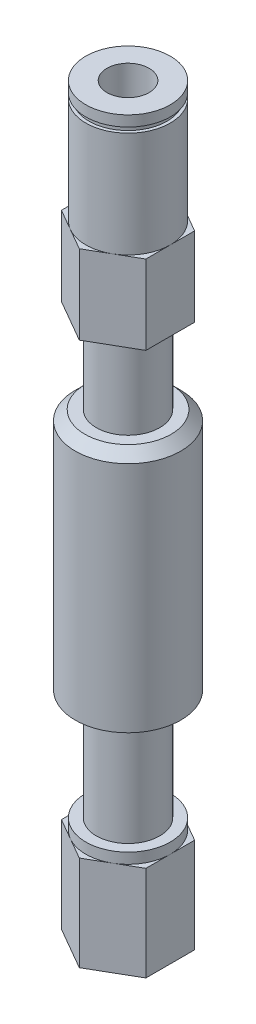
ISO-10303-21;
HEADER;
FILE_DESCRIPTION(('STEP AP214'),'2;1');
FILE_NAME('part.step','',(''),(''),'','','');
FILE_SCHEMA(('AUTOMOTIVE_DESIGN { 1 0 10303 214 1 1 1 1 }'));
ENDSEC;
DATA;
#1=APPLICATION_CONTEXT('core data for automotive mechanical design processes');
#2=APPLICATION_PROTOCOL_DEFINITION('international standard','automotive_design',2000,#1);
#3=PRODUCT_CONTEXT('',#1,'mechanical');
#4=PRODUCT('Part','Part','',(#3));
#5=PRODUCT_RELATED_PRODUCT_CATEGORY('part','',(#4));
#6=PRODUCT_DEFINITION_FORMATION('','',#4);
#7=PRODUCT_DEFINITION_CONTEXT('part definition',#1,'design');
#8=PRODUCT_DEFINITION('design','',#6,#7);
#9=PRODUCT_DEFINITION_SHAPE('','',#8);
#10=(LENGTH_UNIT() NAMED_UNIT(*) SI_UNIT(.MILLI.,.METRE.));
#11=(NAMED_UNIT(*) PLANE_ANGLE_UNIT() SI_UNIT($,.RADIAN.));
#12=(NAMED_UNIT(*) SI_UNIT($,.STERADIAN.) SOLID_ANGLE_UNIT());
#13=UNCERTAINTY_MEASURE_WITH_UNIT(LENGTH_MEASURE(1.E-05),#10,'distance_accuracy_value','');
#14=(GEOMETRIC_REPRESENTATION_CONTEXT(3) GLOBAL_UNCERTAINTY_ASSIGNED_CONTEXT((#13)) GLOBAL_UNIT_ASSIGNED_CONTEXT((#10,
#11,#12)) REPRESENTATION_CONTEXT('',''));
#15=CARTESIAN_POINT('',(0.,0.,0.));
#16=DIRECTION('',(0.,0.,1.));
#17=DIRECTION('',(1.,0.,0.));
#18=AXIS2_PLACEMENT_3D('',#15,#16,#17);
#19=CARTESIAN_POINT('',(0.,70.5,2.));
#20=DIRECTION('',(0.,1.,0.));
#21=DIRECTION('',(0.,0.,1.));
#22=AXIS2_PLACEMENT_3D('',#19,#20,#21);
#23=PLANE('',#22);
#24=CARTESIAN_POINT('',(0.,70.5,0.));
#25=DIRECTION('',(0.,-1.,0.));
#26=DIRECTION('',(0.,0.,-1.));
#27=AXIS2_PLACEMENT_3D('',#24,#25,#26);
#28=CIRCLE('',#27,2.);
#29=CARTESIAN_POINT('',(0.,70.5,-2.));
#30=VERTEX_POINT('',#29);
#31=EDGE_CURVE('E385',#30,#30,#28,.T.);
#32=ORIENTED_EDGE('',*,*,#31,.T.);
#33=EDGE_LOOP('',(#32));
#34=FACE_BOUND('',#33,.T.);
#35=CARTESIAN_POINT('',(0.,70.5,0.));
#36=DIRECTION('',(0.,-1.,0.));
#37=DIRECTION('',(0.,0.,-1.));
#38=AXIS2_PLACEMENT_3D('',#35,#36,#37);
#39=CIRCLE('',#38,4.);
#40=CARTESIAN_POINT('',(0.,70.5,-4.));
#41=VERTEX_POINT('',#40);
#42=EDGE_CURVE('E19',#41,#41,#39,.T.);
#43=ORIENTED_EDGE('',*,*,#42,.F.);
#44=EDGE_LOOP('',(#43));
#45=FACE_BOUND('',#44,.T.);
#46=ADVANCED_FACE('F16',(#34,#45),#23,.T.);
#47=CARTESIAN_POINT('',(0.,70.5,0.));
#48=DIRECTION('',(0.,-1.,0.));
#49=DIRECTION('',(0.,0.,-1.));
#50=AXIS2_PLACEMENT_3D('',#47,#48,#49);
#51=CYLINDRICAL_SURFACE('',#50,4.);
#52=ORIENTED_EDGE('',*,*,#42,.T.);
#53=EDGE_LOOP('',(#52));
#54=FACE_BOUND('',#53,.T.);
#55=CARTESIAN_POINT('',(0.,69.5,0.));
#56=DIRECTION('',(0.,-1.,0.));
#57=DIRECTION('',(0.,0.,-1.));
#58=AXIS2_PLACEMENT_3D('',#55,#56,#57);
#59=CIRCLE('',#58,4.);
#60=CARTESIAN_POINT('',(0.,69.5,-4.));
#61=VERTEX_POINT('',#60);
#62=EDGE_CURVE('E383',#61,#61,#59,.T.);
#63=ORIENTED_EDGE('',*,*,#62,.F.);
#64=EDGE_LOOP('',(#63));
#65=FACE_BOUND('',#64,.T.);
#66=ADVANCED_FACE('F392',(#54,#65),#51,.T.);
#67=CARTESIAN_POINT('',(0.,70.5,0.));
#68=DIRECTION('',(0.,-1.,0.));
#69=DIRECTION('',(0.,0.,-1.));
#70=AXIS2_PLACEMENT_3D('',#67,#68,#69);
#71=CYLINDRICAL_SURFACE('',#70,2.);
#72=CARTESIAN_POINT('',(0.,66.5,0.));
#73=DIRECTION('',(0.,-1.,0.));
#74=DIRECTION('',(0.,0.,-1.));
#75=AXIS2_PLACEMENT_3D('',#72,#73,#74);
#76=CIRCLE('',#75,2.);
#77=CARTESIAN_POINT('',(0.,66.5,-2.));
#78=VERTEX_POINT('',#77);
#79=EDGE_CURVE('E380',#78,#78,#76,.F.);
#80=ORIENTED_EDGE('',*,*,#79,.F.);
#81=EDGE_LOOP('',(#80));
#82=FACE_BOUND('',#81,.T.);
#83=ORIENTED_EDGE('',*,*,#31,.F.);
#84=EDGE_LOOP('',(#83));
#85=FACE_BOUND('',#84,.T.);
#86=ADVANCED_FACE('F401',(#82,#85),#71,.F.);
#87=CARTESIAN_POINT('',(0.,69.5,4.));
#88=DIRECTION('',(0.,-1.,0.));
#89=DIRECTION('',(0.,0.,-1.));
#90=AXIS2_PLACEMENT_3D('',#87,#88,#89);
#91=PLANE('',#90);
#92=ORIENTED_EDGE('',*,*,#62,.T.);
#93=EDGE_LOOP('',(#92));
#94=FACE_BOUND('',#93,.T.);
#95=CARTESIAN_POINT('',(0.,69.5,0.));
#96=DIRECTION('',(0.,-1.,0.));
#97=DIRECTION('',(0.,0.,-1.));
#98=AXIS2_PLACEMENT_3D('',#95,#96,#97);
#99=CIRCLE('',#98,3.7);
#100=CARTESIAN_POINT('',(0.,69.5,-3.7));
#101=VERTEX_POINT('',#100);
#102=EDGE_CURVE('E377',#101,#101,#99,.T.);
#103=ORIENTED_EDGE('',*,*,#102,.F.);
#104=EDGE_LOOP('',(#103));
#105=FACE_BOUND('',#104,.T.);
#106=ADVANCED_FACE('F554',(#94,#105),#91,.T.);
#107=CARTESIAN_POINT('',(0.,66.5,1.));
#108=DIRECTION('',(0.,1.,0.));
#109=DIRECTION('',(0.,0.,1.));
#110=AXIS2_PLACEMENT_3D('',#107,#108,#109);
#111=PLANE('',#110);
#112=CARTESIAN_POINT('',(0.,66.5,0.));
#113=DIRECTION('',(0.,-1.,0.));
#114=DIRECTION('',(0.,0.,-1.));
#115=AXIS2_PLACEMENT_3D('',#112,#113,#114);
#116=CIRCLE('',#115,1.);
#117=CARTESIAN_POINT('',(0.,66.5,-1.));
#118=VERTEX_POINT('',#117);
#119=EDGE_CURVE('E374',#118,#118,#116,.T.);
#120=ORIENTED_EDGE('',*,*,#119,.T.);
#121=EDGE_LOOP('',(#120));
#122=FACE_BOUND('',#121,.T.);
#123=ORIENTED_EDGE('',*,*,#79,.T.);
#124=EDGE_LOOP('',(#123));
#125=FACE_BOUND('',#124,.T.);
#126=ADVANCED_FACE('F550',(#122,#125),#111,.T.);
#127=CARTESIAN_POINT('',(0.,70.5,0.));
#128=DIRECTION('',(0.,-1.,0.));
#129=DIRECTION('',(0.,0.,-1.));
#130=AXIS2_PLACEMENT_3D('',#127,#128,#129);
#131=CYLINDRICAL_SURFACE('',#130,3.7);
#132=ORIENTED_EDGE('',*,*,#102,.T.);
#133=EDGE_LOOP('',(#132));
#134=FACE_BOUND('',#133,.T.);
#135=CARTESIAN_POINT('',(0.,69.,0.));
#136=DIRECTION('',(0.,-1.,0.));
#137=DIRECTION('',(0.,0.,-1.));
#138=AXIS2_PLACEMENT_3D('',#135,#136,#137);
#139=CIRCLE('',#138,3.7);
#140=CARTESIAN_POINT('',(0.,69.,-3.7));
#141=VERTEX_POINT('',#140);
#142=EDGE_CURVE('E371',#141,#141,#139,.T.);
#143=ORIENTED_EDGE('',*,*,#142,.F.);
#144=EDGE_LOOP('',(#143));
#145=FACE_BOUND('',#144,.T.);
#146=ADVANCED_FACE('F546',(#134,#145),#131,.T.);
#147=CARTESIAN_POINT('',(0.,70.5,0.));
#148=DIRECTION('',(0.,-1.,0.));
#149=DIRECTION('',(0.,0.,-1.));
#150=AXIS2_PLACEMENT_3D('',#147,#148,#149);
#151=CYLINDRICAL_SURFACE('',#150,1.);
#152=CARTESIAN_POINT('',(0.,0.,0.));
#153=DIRECTION('',(0.,-1.,0.));
#154=DIRECTION('',(0.,0.,-1.));
#155=AXIS2_PLACEMENT_3D('',#152,#153,#154);
#156=CIRCLE('',#155,1.);
#157=CARTESIAN_POINT('',(0.,0.,-1.));
#158=VERTEX_POINT('',#157);
#159=EDGE_CURVE('E368',#158,#158,#156,.F.);
#160=ORIENTED_EDGE('',*,*,#159,.F.);
#161=EDGE_LOOP('',(#160));
#162=FACE_BOUND('',#161,.T.);
#163=ORIENTED_EDGE('',*,*,#119,.F.);
#164=EDGE_LOOP('',(#163));
#165=FACE_BOUND('',#164,.T.);
#166=ADVANCED_FACE('F542',(#162,#165),#151,.F.);
#167=CARTESIAN_POINT('',(0.,69.,3.7));
#168=DIRECTION('',(0.,1.,0.));
#169=DIRECTION('',(0.,0.,1.));
#170=AXIS2_PLACEMENT_3D('',#167,#168,#169);
#171=PLANE('',#170);
#172=ORIENTED_EDGE('',*,*,#142,.T.);
#173=EDGE_LOOP('',(#172));
#174=FACE_BOUND('',#173,.T.);
#175=CARTESIAN_POINT('',(0.,69.,0.));
#176=DIRECTION('',(0.,-1.,0.));
#177=DIRECTION('',(0.,0.,-1.));
#178=AXIS2_PLACEMENT_3D('',#175,#176,#177);
#179=CIRCLE('',#178,4.);
#180=CARTESIAN_POINT('',(0.,69.,-4.));
#181=VERTEX_POINT('',#180);
#182=EDGE_CURVE('E298',#181,#181,#179,.T.);
#183=ORIENTED_EDGE('',*,*,#182,.F.);
#184=EDGE_LOOP('',(#183));
#185=FACE_BOUND('',#184,.T.);
#186=ADVANCED_FACE('F538',(#174,#185),#171,.T.);
#187=CARTESIAN_POINT('',(0.,0.,5.));
#188=DIRECTION('',(0.,-1.,0.));
#189=DIRECTION('',(0.,0.,-1.));
#190=AXIS2_PLACEMENT_3D('',#187,#188,#189);
#191=PLANE('',#190);
#192=DIRECTION('',(-0.866025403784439,0.,-0.5));
#193=VECTOR('',#192,1.);
#194=CARTESIAN_POINT('',(-4.,0.,2.3094010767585));
#195=LINE('',#194,#193);
#196=CARTESIAN_POINT('',(0.,0.,4.61880215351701));
#197=VERTEX_POINT('',#196);
#198=CARTESIAN_POINT('',(-4.,0.,2.3094010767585));
#199=VERTEX_POINT('',#198);
#200=EDGE_CURVE('E290',#197,#199,#195,.T.);
#201=ORIENTED_EDGE('',*,*,#200,.T.);
#202=DIRECTION('',(0.,0.,-1.));
#203=VECTOR('',#202,1.);
#204=CARTESIAN_POINT('',(-4.,0.,-2.3094010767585));
#205=LINE('',#204,#203);
#206=CARTESIAN_POINT('',(-4.,0.,-2.3094010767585));
#207=VERTEX_POINT('',#206);
#208=EDGE_CURVE('E149',#199,#207,#205,.T.);
#209=ORIENTED_EDGE('',*,*,#208,.T.);
#210=DIRECTION('',(0.866025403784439,0.,-0.5));
#211=VECTOR('',#210,1.);
#212=CARTESIAN_POINT('',(0.,0.,-4.61880215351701));
#213=LINE('',#212,#211);
#214=CARTESIAN_POINT('',(0.,0.,-4.61880215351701));
#215=VERTEX_POINT('',#214);
#216=EDGE_CURVE('E270',#207,#215,#213,.T.);
#217=ORIENTED_EDGE('',*,*,#216,.T.);
#218=DIRECTION('',(0.866025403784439,0.,0.5));
#219=VECTOR('',#218,1.);
#220=CARTESIAN_POINT('',(4.,0.,-2.3094010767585));
#221=LINE('',#220,#219);
#222=CARTESIAN_POINT('',(4.,0.,-2.3094010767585));
#223=VERTEX_POINT('',#222);
#224=EDGE_CURVE('E275',#215,#223,#221,.T.);
#225=ORIENTED_EDGE('',*,*,#224,.T.);
#226=DIRECTION('',(0.,0.,1.));
#227=VECTOR('',#226,1.);
#228=CARTESIAN_POINT('',(4.,0.,2.3094010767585));
#229=LINE('',#228,#227);
#230=CARTESIAN_POINT('',(4.,0.,2.3094010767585));
#231=VERTEX_POINT('',#230);
#232=EDGE_CURVE('E280',#223,#231,#229,.T.);
#233=ORIENTED_EDGE('',*,*,#232,.T.);
#234=DIRECTION('',(-0.866025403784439,0.,0.5));
#235=VECTOR('',#234,1.);
#236=CARTESIAN_POINT('',(0.,0.,4.61880215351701));
#237=LINE('',#236,#235);
#238=EDGE_CURVE('E285',#231,#197,#237,.T.);
#239=ORIENTED_EDGE('',*,*,#238,.T.);
#240=EDGE_LOOP('',(#201,#209,#217,#225,#233,#239));
#241=FACE_BOUND('',#240,.T.);
#242=ORIENTED_EDGE('',*,*,#159,.T.);
#243=EDGE_LOOP('',(#242));
#244=FACE_BOUND('',#243,.T.);
#245=ADVANCED_FACE('F534',(#241,#244),#191,.T.);
#246=CARTESIAN_POINT('',(0.,70.5,0.));
#247=DIRECTION('',(0.,-1.,0.));
#248=DIRECTION('',(0.,0.,-1.));
#249=AXIS2_PLACEMENT_3D('',#246,#247,#248);
#250=CYLINDRICAL_SURFACE('',#249,4.);
#251=ORIENTED_EDGE('',*,*,#182,.T.);
#252=EDGE_LOOP('',(#251));
#253=FACE_BOUND('',#252,.T.);
#254=CARTESIAN_POINT('',(0.,59.,0.));
#255=DIRECTION('',(0.,-1.,0.));
#256=DIRECTION('',(0.,0.,-1.));
#257=AXIS2_PLACEMENT_3D('',#254,#255,#256);
#258=CIRCLE('',#257,4.);
#259=CARTESIAN_POINT('',(-2.,59.,-3.46410161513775));
#260=VERTEX_POINT('',#259);
#261=CARTESIAN_POINT('',(2.,59.,-3.46410161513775));
#262=VERTEX_POINT('',#261);
#263=EDGE_CURVE('E137',#260,#262,#258,.T.);
#264=ORIENTED_EDGE('',*,*,#263,.F.);
#265=CARTESIAN_POINT('',(0.,59.,0.));
#266=DIRECTION('',(0.,-1.,0.));
#267=DIRECTION('',(0.,0.,-1.));
#268=AXIS2_PLACEMENT_3D('',#265,#266,#267);
#269=CIRCLE('',#268,4.);
#270=CARTESIAN_POINT('',(-4.,59.,0.));
#271=VERTEX_POINT('',#270);
#272=EDGE_CURVE('E141',#271,#260,#269,.T.);
#273=ORIENTED_EDGE('',*,*,#272,.F.);
#274=CARTESIAN_POINT('',(0.,59.,0.));
#275=DIRECTION('',(0.,-1.,0.));
#276=DIRECTION('',(0.,0.,-1.));
#277=AXIS2_PLACEMENT_3D('',#274,#275,#276);
#278=CIRCLE('',#277,4.);
#279=CARTESIAN_POINT('',(-2.,59.,3.46410161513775));
#280=VERTEX_POINT('',#279);
#281=EDGE_CURVE('E166',#280,#271,#278,.T.);
#282=ORIENTED_EDGE('',*,*,#281,.F.);
#283=CARTESIAN_POINT('',(0.,59.,0.));
#284=DIRECTION('',(0.,-1.,0.));
#285=DIRECTION('',(0.,0.,-1.));
#286=AXIS2_PLACEMENT_3D('',#283,#284,#285);
#287=CIRCLE('',#286,4.);
#288=CARTESIAN_POINT('',(2.,59.,3.46410161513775));
#289=VERTEX_POINT('',#288);
#290=EDGE_CURVE('E167',#289,#280,#287,.T.);
#291=ORIENTED_EDGE('',*,*,#290,.F.);
#292=CARTESIAN_POINT('',(0.,59.,0.));
#293=DIRECTION('',(0.,-1.,0.));
#294=DIRECTION('',(0.,0.,-1.));
#295=AXIS2_PLACEMENT_3D('',#292,#293,#294);
#296=CIRCLE('',#295,4.);
#297=CARTESIAN_POINT('',(4.,59.,0.));
#298=VERTEX_POINT('',#297);
#299=EDGE_CURVE('E362',#298,#289,#296,.T.);
#300=ORIENTED_EDGE('',*,*,#299,.F.);
#301=CARTESIAN_POINT('',(0.,59.,0.));
#302=DIRECTION('',(0.,-1.,0.));
#303=DIRECTION('',(0.,0.,-1.));
#304=AXIS2_PLACEMENT_3D('',#301,#302,#303);
#305=CIRCLE('',#304,4.);
#306=EDGE_CURVE('E144',#262,#298,#305,.T.);
#307=ORIENTED_EDGE('',*,*,#306,.F.);
#308=EDGE_LOOP('',(#264,#273,#282,#291,#300,#307));
#309=FACE_BOUND('',#308,.T.);
#310=ADVANCED_FACE('F139',(#253,#309),#250,.T.);
#311=CARTESIAN_POINT('',(-4.,9.,2.3094010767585));
#312=DIRECTION('',(0.5,0.,-0.866025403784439));
#313=DIRECTION('',(-0.866025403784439,0.,-0.5));
#314=AXIS2_PLACEMENT_3D('',#311,#312,#313);
#315=PLANE('',#314);
#316=DIRECTION('',(0.,1.,0.));
#317=VECTOR('',#316,1.);
#318=CARTESIAN_POINT('',(0.,9.,4.61880215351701));
#319=LINE('',#318,#317);
#320=CARTESIAN_POINT('',(0.,9.,4.61880215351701));
#321=VERTEX_POINT('',#320);
#322=EDGE_CURVE('E288',#197,#321,#319,.T.);
#323=ORIENTED_EDGE('',*,*,#322,.T.);
#324=DIRECTION('',(0.866025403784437,0.,0.5));
#325=VECTOR('',#324,1.);
#326=CARTESIAN_POINT('',(-2.,9.,3.46410161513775));
#327=LINE('',#326,#325);
#328=CARTESIAN_POINT('',(-2.,9.,3.46410161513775));
#329=VERTEX_POINT('',#328);
#330=EDGE_CURVE('E863',#329,#321,#327,.T.);
#331=ORIENTED_EDGE('',*,*,#330,.F.);
#332=DIRECTION('',(0.866025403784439,0.,0.5));
#333=VECTOR('',#332,1.);
#334=CARTESIAN_POINT('',(-4.,9.,2.3094010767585));
#335=LINE('',#334,#333);
#336=CARTESIAN_POINT('',(-4.,9.,2.3094010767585));
#337=VERTEX_POINT('',#336);
#338=EDGE_CURVE('E358',#337,#329,#335,.T.);
#339=ORIENTED_EDGE('',*,*,#338,.F.);
#340=DIRECTION('',(0.,1.,0.));
#341=VECTOR('',#340,1.);
#342=CARTESIAN_POINT('',(-4.,9.,2.3094010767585));
#343=LINE('',#342,#341);
#344=EDGE_CURVE('E269',#337,#199,#343,.F.);
#345=ORIENTED_EDGE('',*,*,#344,.T.);
#346=ORIENTED_EDGE('',*,*,#200,.F.);
#347=EDGE_LOOP('',(#323,#331,#339,#345,#346));
#348=FACE_BOUND('',#347,.T.);
#349=ADVANCED_FACE('F527',(#348),#315,.F.);
#350=CARTESIAN_POINT('',(0.,9.,4.61880215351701));
#351=DIRECTION('',(-0.5,0.,-0.866025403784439));
#352=DIRECTION('',(-0.866025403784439,0.,0.5));
#353=AXIS2_PLACEMENT_3D('',#350,#351,#352);
#354=PLANE('',#353);
#355=DIRECTION('',(0.,1.,0.));
#356=VECTOR('',#355,1.);
#357=CARTESIAN_POINT('',(4.,9.,2.3094010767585));
#358=LINE('',#357,#356);
#359=CARTESIAN_POINT('',(4.,9.,2.3094010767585));
#360=VERTEX_POINT('',#359);
#361=EDGE_CURVE('E283',#231,#360,#358,.T.);
#362=ORIENTED_EDGE('',*,*,#361,.T.);
#363=DIRECTION('',(0.866025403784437,0.,-0.5));
#364=VECTOR('',#363,1.);
#365=CARTESIAN_POINT('',(2.,9.,3.46410161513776));
#366=LINE('',#365,#364);
#367=CARTESIAN_POINT('',(2.,9.,3.46410161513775));
#368=VERTEX_POINT('',#367);
#369=EDGE_CURVE('E859',#368,#360,#366,.T.);
#370=ORIENTED_EDGE('',*,*,#369,.F.);
#371=DIRECTION('',(0.866025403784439,0.,-0.5));
#372=VECTOR('',#371,1.);
#373=CARTESIAN_POINT('',(0.,9.,4.61880215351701));
#374=LINE('',#373,#372);
#375=EDGE_CURVE('E861',#321,#368,#374,.T.);
#376=ORIENTED_EDGE('',*,*,#375,.F.);
#377=ORIENTED_EDGE('',*,*,#322,.F.);
#378=ORIENTED_EDGE('',*,*,#238,.F.);
#379=EDGE_LOOP('',(#362,#370,#376,#377,#378));
#380=FACE_BOUND('',#379,.T.);
#381=ADVANCED_FACE('F523',(#380),#354,.F.);
#382=CARTESIAN_POINT('',(4.,9.,2.3094010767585));
#383=DIRECTION('',(-1.,0.,0.));
#384=DIRECTION('',(0.,0.,1.));
#385=AXIS2_PLACEMENT_3D('',#382,#383,#384);
#386=PLANE('',#385);
#387=DIRECTION('',(0.,1.,0.));
#388=VECTOR('',#387,1.);
#389=CARTESIAN_POINT('',(4.,9.,-2.3094010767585));
#390=LINE('',#389,#388);
#391=CARTESIAN_POINT('',(4.,9.,-2.3094010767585));
#392=VERTEX_POINT('',#391);
#393=EDGE_CURVE('E278',#223,#392,#390,.T.);
#394=ORIENTED_EDGE('',*,*,#393,.T.);
#395=DIRECTION('',(0.,0.,1.));
#396=VECTOR('',#395,1.);
#397=CARTESIAN_POINT('',(4.,9.,4.));
#398=LINE('',#397,#396);
#399=CARTESIAN_POINT('',(4.,9.,0.));
#400=VERTEX_POINT('',#399);
#401=EDGE_CURVE('E854',#400,#392,#398,.F.);
#402=ORIENTED_EDGE('',*,*,#401,.F.);
#403=DIRECTION('',(0.,0.,1.));
#404=VECTOR('',#403,1.);
#405=CARTESIAN_POINT('',(4.,9.,4.));
#406=LINE('',#405,#404);
#407=EDGE_CURVE('E856',#360,#400,#406,.F.);
#408=ORIENTED_EDGE('',*,*,#407,.F.);
#409=ORIENTED_EDGE('',*,*,#361,.F.);
#410=ORIENTED_EDGE('',*,*,#232,.F.);
#411=EDGE_LOOP('',(#394,#402,#408,#409,#410));
#412=FACE_BOUND('',#411,.T.);
#413=ADVANCED_FACE('F519',(#412),#386,.F.);
#414=CARTESIAN_POINT('',(4.,9.,-2.3094010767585));
#415=DIRECTION('',(-0.5,0.,0.866025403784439));
#416=DIRECTION('',(0.866025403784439,0.,0.5));
#417=AXIS2_PLACEMENT_3D('',#414,#415,#416);
#418=PLANE('',#417);
#419=DIRECTION('',(0.,1.,0.));
#420=VECTOR('',#419,1.);
#421=CARTESIAN_POINT('',(0.,9.,-4.61880215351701));
#422=LINE('',#421,#420);
#423=CARTESIAN_POINT('',(0.,9.,-4.61880215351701));
#424=VERTEX_POINT('',#423);
#425=EDGE_CURVE('E273',#215,#424,#422,.T.);
#426=ORIENTED_EDGE('',*,*,#425,.T.);
#427=DIRECTION('',(-0.866025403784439,0.,-0.5));
#428=VECTOR('',#427,1.);
#429=CARTESIAN_POINT('',(2.,9.,-3.46410161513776));
#430=LINE('',#429,#428);
#431=CARTESIAN_POINT('',(2.,9.,-3.46410161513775));
#432=VERTEX_POINT('',#431);
#433=EDGE_CURVE('E874',#432,#424,#430,.T.);
#434=ORIENTED_EDGE('',*,*,#433,.F.);
#435=DIRECTION('',(-0.866025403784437,0.,-0.5));
#436=VECTOR('',#435,1.);
#437=CARTESIAN_POINT('',(4.,9.,-2.3094010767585));
#438=LINE('',#437,#436);
#439=EDGE_CURVE('E851',#392,#432,#438,.T.);
#440=ORIENTED_EDGE('',*,*,#439,.F.);
#441=ORIENTED_EDGE('',*,*,#393,.F.);
#442=ORIENTED_EDGE('',*,*,#224,.F.);
#443=EDGE_LOOP('',(#426,#434,#440,#441,#442));
#444=FACE_BOUND('',#443,.T.);
#445=ADVANCED_FACE('F515',(#444),#418,.F.);
#446=CARTESIAN_POINT('',(0.,9.,-4.61880215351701));
#447=DIRECTION('',(0.5,0.,0.866025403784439));
#448=DIRECTION('',(0.866025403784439,0.,-0.5));
#449=AXIS2_PLACEMENT_3D('',#446,#447,#448);
#450=PLANE('',#449);
#451=DIRECTION('',(0.,1.,0.));
#452=VECTOR('',#451,1.);
#453=CARTESIAN_POINT('',(-4.,9.,-2.3094010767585));
#454=LINE('',#453,#452);
#455=CARTESIAN_POINT('',(-4.,9.,-2.3094010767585));
#456=VERTEX_POINT('',#455);
#457=EDGE_CURVE('E267',#207,#456,#454,.T.);
#458=ORIENTED_EDGE('',*,*,#457,.T.);
#459=DIRECTION('',(-0.866025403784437,0.,0.5));
#460=VECTOR('',#459,1.);
#461=CARTESIAN_POINT('',(-2.,9.,-3.46410161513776));
#462=LINE('',#461,#460);
#463=CARTESIAN_POINT('',(-2.,9.,-3.46410161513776));
#464=VERTEX_POINT('',#463);
#465=EDGE_CURVE('E844',#464,#456,#462,.T.);
#466=ORIENTED_EDGE('',*,*,#465,.F.);
#467=DIRECTION('',(-0.866025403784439,0.,0.5));
#468=VECTOR('',#467,1.);
#469=CARTESIAN_POINT('',(0.,9.,-4.61880215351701));
#470=LINE('',#469,#468);
#471=EDGE_CURVE('E885',#424,#464,#470,.T.);
#472=ORIENTED_EDGE('',*,*,#471,.F.);
#473=ORIENTED_EDGE('',*,*,#425,.F.);
#474=ORIENTED_EDGE('',*,*,#216,.F.);
#475=EDGE_LOOP('',(#458,#466,#472,#473,#474));
#476=FACE_BOUND('',#475,.T.);
#477=ADVANCED_FACE('F511',(#476),#450,.F.);
#478=CARTESIAN_POINT('',(-4.,9.,-2.3094010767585));
#479=DIRECTION('',(1.,0.,0.));
#480=DIRECTION('',(0.,0.,-1.));
#481=AXIS2_PLACEMENT_3D('',#478,#479,#480);
#482=PLANE('',#481);
#483=ORIENTED_EDGE('',*,*,#344,.F.);
#484=DIRECTION('',(0.,0.,1.));
#485=VECTOR('',#484,1.);
#486=CARTESIAN_POINT('',(-4.,9.,4.));
#487=LINE('',#486,#485);
#488=CARTESIAN_POINT('',(-4.,9.,0.));
#489=VERTEX_POINT('',#488);
#490=EDGE_CURVE('E865',#489,#337,#487,.T.);
#491=ORIENTED_EDGE('',*,*,#490,.F.);
#492=DIRECTION('',(0.,0.,1.));
#493=VECTOR('',#492,1.);
#494=CARTESIAN_POINT('',(-4.,9.,4.));
#495=LINE('',#494,#493);
#496=EDGE_CURVE('E158',#456,#489,#495,.T.);
#497=ORIENTED_EDGE('',*,*,#496,.F.);
#498=ORIENTED_EDGE('',*,*,#457,.F.);
#499=ORIENTED_EDGE('',*,*,#208,.F.);
#500=EDGE_LOOP('',(#483,#491,#497,#498,#499));
#501=FACE_BOUND('',#500,.T.);
#502=ADVANCED_FACE('F508',(#501),#482,.F.);
#503=CARTESIAN_POINT('',(0.,59.,4.));
#504=DIRECTION('',(0.,1.,0.));
#505=DIRECTION('',(0.,0.,1.));
#506=AXIS2_PLACEMENT_3D('',#503,#504,#505);
#507=PLANE('',#506);
#508=ORIENTED_EDGE('',*,*,#263,.T.);
#509=DIRECTION('',(0.866025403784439,0.,0.5));
#510=VECTOR('',#509,1.);
#511=CARTESIAN_POINT('',(4.,59.,-2.3094010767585));
#512=LINE('',#511,#510);
#513=CARTESIAN_POINT('',(0.,59.,-4.61880215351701));
#514=VERTEX_POINT('',#513);
#515=EDGE_CURVE('E153',#262,#514,#512,.F.);
#516=ORIENTED_EDGE('',*,*,#515,.T.);
#517=DIRECTION('',(0.866025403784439,0.,-0.5));
#518=VECTOR('',#517,1.);
#519=CARTESIAN_POINT('',(0.,59.,-4.61880215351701));
#520=LINE('',#519,#518);
#521=EDGE_CURVE('E151',#514,#260,#520,.F.);
#522=ORIENTED_EDGE('',*,*,#521,.T.);
#523=EDGE_LOOP('',(#508,#516,#522));
#524=FACE_BOUND('',#523,.T.);
#525=ADVANCED_FACE('F152',(#524),#507,.T.);
#526=CARTESIAN_POINT('',(0.,59.,4.));
#527=DIRECTION('',(0.,1.,0.));
#528=DIRECTION('',(0.,0.,1.));
#529=AXIS2_PLACEMENT_3D('',#526,#527,#528);
#530=PLANE('',#529);
#531=ORIENTED_EDGE('',*,*,#306,.T.);
#532=DIRECTION('',(0.,0.,1.));
#533=VECTOR('',#532,1.);
#534=CARTESIAN_POINT('',(4.,59.,2.3094010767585));
#535=LINE('',#534,#533);
#536=CARTESIAN_POINT('',(4.,59.,-2.3094010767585));
#537=VERTEX_POINT('',#536);
#538=EDGE_CURVE('E233',#298,#537,#535,.F.);
#539=ORIENTED_EDGE('',*,*,#538,.T.);
#540=DIRECTION('',(0.866025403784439,0.,0.5));
#541=VECTOR('',#540,1.);
#542=CARTESIAN_POINT('',(4.,59.,-2.3094010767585));
#543=LINE('',#542,#541);
#544=EDGE_CURVE('E175',#537,#262,#543,.F.);
#545=ORIENTED_EDGE('',*,*,#544,.T.);
#546=EDGE_LOOP('',(#531,#539,#545));
#547=FACE_BOUND('',#546,.T.);
#548=ADVANCED_FACE('F501',(#547),#530,.T.);
#549=CARTESIAN_POINT('',(0.,59.,4.));
#550=DIRECTION('',(0.,1.,0.));
#551=DIRECTION('',(0.,0.,1.));
#552=AXIS2_PLACEMENT_3D('',#549,#550,#551);
#553=PLANE('',#552);
#554=ORIENTED_EDGE('',*,*,#299,.T.);
#555=DIRECTION('',(-0.866025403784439,0.,0.5));
#556=VECTOR('',#555,1.);
#557=CARTESIAN_POINT('',(0.,59.,4.61880215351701));
#558=LINE('',#557,#556);
#559=CARTESIAN_POINT('',(4.,59.,2.30940107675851));
#560=VERTEX_POINT('',#559);
#561=EDGE_CURVE('E214',#289,#560,#558,.F.);
#562=ORIENTED_EDGE('',*,*,#561,.T.);
#563=DIRECTION('',(0.,0.,1.));
#564=VECTOR('',#563,1.);
#565=CARTESIAN_POINT('',(4.,59.,2.3094010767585));
#566=LINE('',#565,#564);
#567=EDGE_CURVE('E236',#560,#298,#566,.F.);
#568=ORIENTED_EDGE('',*,*,#567,.T.);
#569=EDGE_LOOP('',(#554,#562,#568));
#570=FACE_BOUND('',#569,.T.);
#571=ADVANCED_FACE('F497',(#570),#553,.T.);
#572=CARTESIAN_POINT('',(0.,59.,4.));
#573=DIRECTION('',(0.,1.,0.));
#574=DIRECTION('',(0.,0.,1.));
#575=AXIS2_PLACEMENT_3D('',#572,#573,#574);
#576=PLANE('',#575);
#577=DIRECTION('',(-0.866025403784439,0.,0.5));
#578=VECTOR('',#577,1.);
#579=CARTESIAN_POINT('',(0.,59.,4.61880215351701));
#580=LINE('',#579,#578);
#581=CARTESIAN_POINT('',(0.,59.,4.61880215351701));
#582=VERTEX_POINT('',#581);
#583=EDGE_CURVE('E217',#582,#289,#580,.F.);
#584=ORIENTED_EDGE('',*,*,#583,.T.);
#585=ORIENTED_EDGE('',*,*,#290,.T.);
#586=DIRECTION('',(-0.866025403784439,0.,-0.5));
#587=VECTOR('',#586,1.);
#588=CARTESIAN_POINT('',(-4.,59.,2.3094010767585));
#589=LINE('',#588,#587);
#590=EDGE_CURVE('E200',#280,#582,#589,.F.);
#591=ORIENTED_EDGE('',*,*,#590,.T.);
#592=EDGE_LOOP('',(#584,#585,#591));
#593=FACE_BOUND('',#592,.T.);
#594=ADVANCED_FACE('F494',(#593),#576,.T.);
#595=CARTESIAN_POINT('',(0.,59.,4.));
#596=DIRECTION('',(0.,1.,0.));
#597=DIRECTION('',(0.,0.,1.));
#598=AXIS2_PLACEMENT_3D('',#595,#596,#597);
#599=PLANE('',#598);
#600=DIRECTION('',(0.,0.,-1.));
#601=VECTOR('',#600,1.);
#602=CARTESIAN_POINT('',(-4.,59.,-2.3094010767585));
#603=LINE('',#602,#601);
#604=CARTESIAN_POINT('',(-4.,59.,-2.3094010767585));
#605=VERTEX_POINT('',#604);
#606=EDGE_CURVE('E164',#605,#271,#603,.F.);
#607=ORIENTED_EDGE('',*,*,#606,.T.);
#608=ORIENTED_EDGE('',*,*,#272,.T.);
#609=DIRECTION('',(0.866025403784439,0.,-0.5));
#610=VECTOR('',#609,1.);
#611=CARTESIAN_POINT('',(0.,59.,-4.61880215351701));
#612=LINE('',#611,#610);
#613=EDGE_CURVE('E157',#260,#605,#612,.F.);
#614=ORIENTED_EDGE('',*,*,#613,.T.);
#615=EDGE_LOOP('',(#607,#608,#614));
#616=FACE_BOUND('',#615,.T.);
#617=ADVANCED_FACE('F161',(#616),#599,.T.);
#618=CARTESIAN_POINT('',(0.,59.,4.));
#619=DIRECTION('',(0.,1.,0.));
#620=DIRECTION('',(0.,0.,1.));
#621=AXIS2_PLACEMENT_3D('',#618,#619,#620);
#622=PLANE('',#621);
#623=ORIENTED_EDGE('',*,*,#281,.T.);
#624=DIRECTION('',(0.,0.,-1.));
#625=VECTOR('',#624,1.);
#626=CARTESIAN_POINT('',(-4.,59.,-2.3094010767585));
#627=LINE('',#626,#625);
#628=CARTESIAN_POINT('',(-4.,59.,2.3094010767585));
#629=VERTEX_POINT('',#628);
#630=EDGE_CURVE('E357',#271,#629,#627,.F.);
#631=ORIENTED_EDGE('',*,*,#630,.T.);
#632=DIRECTION('',(-0.866025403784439,0.,-0.5));
#633=VECTOR('',#632,1.);
#634=CARTESIAN_POINT('',(-4.,59.,2.3094010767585));
#635=LINE('',#634,#633);
#636=EDGE_CURVE('E197',#629,#280,#635,.F.);
#637=ORIENTED_EDGE('',*,*,#636,.T.);
#638=EDGE_LOOP('',(#623,#631,#637));
#639=FACE_BOUND('',#638,.T.);
#640=ADVANCED_FACE('F487',(#639),#622,.T.);
#641=CARTESIAN_POINT('',(0.,9.,4.));
#642=DIRECTION('',(0.,1.,0.));
#643=DIRECTION('',(0.,0.,1.));
#644=AXIS2_PLACEMENT_3D('',#641,#642,#643);
#645=PLANE('',#644);
#646=CARTESIAN_POINT('',(0.,9.,0.));
#647=DIRECTION('',(0.,-1.,0.));
#648=DIRECTION('',(0.,0.,-1.));
#649=AXIS2_PLACEMENT_3D('',#646,#647,#648);
#650=CIRCLE('',#649,4.);
#651=EDGE_CURVE('E354',#489,#329,#650,.F.);
#652=ORIENTED_EDGE('',*,*,#651,.F.);
#653=ORIENTED_EDGE('',*,*,#490,.T.);
#654=ORIENTED_EDGE('',*,*,#338,.T.);
#655=EDGE_LOOP('',(#652,#653,#654));
#656=FACE_BOUND('',#655,.T.);
#657=ADVANCED_FACE('F483',(#656),#645,.T.);
#658=CARTESIAN_POINT('',(0.,9.,4.));
#659=DIRECTION('',(0.,1.,0.));
#660=DIRECTION('',(0.,0.,1.));
#661=AXIS2_PLACEMENT_3D('',#658,#659,#660);
#662=PLANE('',#661);
#663=ORIENTED_EDGE('',*,*,#375,.T.);
#664=CARTESIAN_POINT('',(0.,9.,0.));
#665=DIRECTION('',(0.,-1.,0.));
#666=DIRECTION('',(0.,0.,-1.));
#667=AXIS2_PLACEMENT_3D('',#664,#665,#666);
#668=CIRCLE('',#667,4.);
#669=EDGE_CURVE('E351',#329,#368,#668,.F.);
#670=ORIENTED_EDGE('',*,*,#669,.F.);
#671=ORIENTED_EDGE('',*,*,#330,.T.);
#672=EDGE_LOOP('',(#663,#670,#671));
#673=FACE_BOUND('',#672,.T.);
#674=ADVANCED_FACE('F479',(#673),#662,.T.);
#675=CARTESIAN_POINT('',(0.,9.,4.));
#676=DIRECTION('',(0.,1.,0.));
#677=DIRECTION('',(0.,0.,1.));
#678=AXIS2_PLACEMENT_3D('',#675,#676,#677);
#679=PLANE('',#678);
#680=CARTESIAN_POINT('',(0.,9.,0.));
#681=DIRECTION('',(0.,-1.,0.));
#682=DIRECTION('',(0.,0.,-1.));
#683=AXIS2_PLACEMENT_3D('',#680,#681,#682);
#684=CIRCLE('',#683,4.);
#685=EDGE_CURVE('E348',#368,#400,#684,.F.);
#686=ORIENTED_EDGE('',*,*,#685,.F.);
#687=ORIENTED_EDGE('',*,*,#369,.T.);
#688=ORIENTED_EDGE('',*,*,#407,.T.);
#689=EDGE_LOOP('',(#686,#687,#688));
#690=FACE_BOUND('',#689,.T.);
#691=ADVANCED_FACE('F475',(#690),#679,.T.);
#692=CARTESIAN_POINT('',(0.,9.,4.));
#693=DIRECTION('',(0.,1.,0.));
#694=DIRECTION('',(0.,0.,1.));
#695=AXIS2_PLACEMENT_3D('',#692,#693,#694);
#696=PLANE('',#695);
#697=CARTESIAN_POINT('',(0.,9.,0.));
#698=DIRECTION('',(0.,-1.,0.));
#699=DIRECTION('',(0.,0.,-1.));
#700=AXIS2_PLACEMENT_3D('',#697,#698,#699);
#701=CIRCLE('',#700,4.);
#702=EDGE_CURVE('E345',#400,#432,#701,.F.);
#703=ORIENTED_EDGE('',*,*,#702,.F.);
#704=ORIENTED_EDGE('',*,*,#401,.T.);
#705=ORIENTED_EDGE('',*,*,#439,.T.);
#706=EDGE_LOOP('',(#703,#704,#705));
#707=FACE_BOUND('',#706,.T.);
#708=ADVANCED_FACE('F471',(#707),#696,.T.);
#709=CARTESIAN_POINT('',(0.,9.,4.));
#710=DIRECTION('',(0.,1.,0.));
#711=DIRECTION('',(0.,0.,1.));
#712=AXIS2_PLACEMENT_3D('',#709,#710,#711);
#713=PLANE('',#712);
#714=CARTESIAN_POINT('',(0.,9.,0.));
#715=DIRECTION('',(0.,-1.,0.));
#716=DIRECTION('',(0.,0.,-1.));
#717=AXIS2_PLACEMENT_3D('',#714,#715,#716);
#718=CIRCLE('',#717,4.);
#719=EDGE_CURVE('E342',#432,#464,#718,.F.);
#720=ORIENTED_EDGE('',*,*,#719,.F.);
#721=ORIENTED_EDGE('',*,*,#433,.T.);
#722=ORIENTED_EDGE('',*,*,#471,.T.);
#723=EDGE_LOOP('',(#720,#721,#722));
#724=FACE_BOUND('',#723,.T.);
#725=ADVANCED_FACE('F467',(#724),#713,.T.);
#726=CARTESIAN_POINT('',(0.,9.,4.));
#727=DIRECTION('',(0.,1.,0.));
#728=DIRECTION('',(0.,0.,1.));
#729=AXIS2_PLACEMENT_3D('',#726,#727,#728);
#730=PLANE('',#729);
#731=ORIENTED_EDGE('',*,*,#496,.T.);
#732=CARTESIAN_POINT('',(0.,9.,0.));
#733=DIRECTION('',(0.,-1.,0.));
#734=DIRECTION('',(0.,0.,-1.));
#735=AXIS2_PLACEMENT_3D('',#732,#733,#734);
#736=CIRCLE('',#735,4.);
#737=EDGE_CURVE('E187',#464,#489,#736,.F.);
#738=ORIENTED_EDGE('',*,*,#737,.F.);
#739=ORIENTED_EDGE('',*,*,#465,.T.);
#740=EDGE_LOOP('',(#731,#738,#739));
#741=FACE_BOUND('',#740,.T.);
#742=ADVANCED_FACE('F464',(#741),#730,.T.);
#743=CARTESIAN_POINT('',(0.,60.5,-4.61880215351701));
#744=DIRECTION('',(0.5,0.,0.866025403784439));
#745=DIRECTION('',(0.866025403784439,0.,-0.5));
#746=AXIS2_PLACEMENT_3D('',#743,#744,#745);
#747=PLANE('',#746);
#748=ORIENTED_EDGE('',*,*,#521,.F.);
#749=DIRECTION('',(0.,1.,0.));
#750=VECTOR('',#749,1.);
#751=CARTESIAN_POINT('',(0.,60.5,-4.61880215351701));
#752=LINE('',#751,#750);
#753=CARTESIAN_POINT('',(0.,51.5,-4.61880215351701));
#754=VERTEX_POINT('',#753);
#755=EDGE_CURVE('E173',#514,#754,#752,.F.);
#756=ORIENTED_EDGE('',*,*,#755,.T.);
#757=DIRECTION('',(0.866025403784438,0.,-0.5));
#758=VECTOR('',#757,1.);
#759=CARTESIAN_POINT('',(-4.,51.5,-2.3094010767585));
#760=LINE('',#759,#758);
#761=CARTESIAN_POINT('',(-4.,51.5,-2.3094010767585));
#762=VERTEX_POINT('',#761);
#763=EDGE_CURVE('E183',#762,#754,#760,.T.);
#764=ORIENTED_EDGE('',*,*,#763,.F.);
#765=DIRECTION('',(0.,1.,0.));
#766=VECTOR('',#765,1.);
#767=CARTESIAN_POINT('',(-4.,60.5,-2.3094010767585));
#768=LINE('',#767,#766);
#769=EDGE_CURVE('E172',#762,#605,#768,.T.);
#770=ORIENTED_EDGE('',*,*,#769,.T.);
#771=ORIENTED_EDGE('',*,*,#613,.F.);
#772=EDGE_LOOP('',(#748,#756,#764,#770,#771));
#773=FACE_BOUND('',#772,.T.);
#774=ADVANCED_FACE('F169',(#773),#747,.F.);
#775=CARTESIAN_POINT('',(4.,60.5,-2.3094010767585));
#776=DIRECTION('',(-0.5,0.,0.866025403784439));
#777=DIRECTION('',(0.866025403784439,0.,0.5));
#778=AXIS2_PLACEMENT_3D('',#775,#776,#777);
#779=PLANE('',#778);
#780=ORIENTED_EDGE('',*,*,#544,.F.);
#781=DIRECTION('',(0.,1.,0.));
#782=VECTOR('',#781,1.);
#783=CARTESIAN_POINT('',(4.,60.5,-2.3094010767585));
#784=LINE('',#783,#782);
#785=CARTESIAN_POINT('',(4.,51.5,-2.3094010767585));
#786=VERTEX_POINT('',#785);
#787=EDGE_CURVE('E239',#537,#786,#784,.F.);
#788=ORIENTED_EDGE('',*,*,#787,.T.);
#789=DIRECTION('',(0.866025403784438,0.,0.5));
#790=VECTOR('',#789,1.);
#791=CARTESIAN_POINT('',(0.,51.5,-4.61880215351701));
#792=LINE('',#791,#790);
#793=EDGE_CURVE('E186',#754,#786,#792,.T.);
#794=ORIENTED_EDGE('',*,*,#793,.F.);
#795=ORIENTED_EDGE('',*,*,#755,.F.);
#796=ORIENTED_EDGE('',*,*,#515,.F.);
#797=EDGE_LOOP('',(#780,#788,#794,#795,#796));
#798=FACE_BOUND('',#797,.T.);
#799=ADVANCED_FACE('F457',(#798),#779,.F.);
#800=CARTESIAN_POINT('',(4.,60.5,2.3094010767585));
#801=DIRECTION('',(-1.,0.,0.));
#802=DIRECTION('',(0.,0.,1.));
#803=AXIS2_PLACEMENT_3D('',#800,#801,#802);
#804=PLANE('',#803);
#805=ORIENTED_EDGE('',*,*,#567,.F.);
#806=DIRECTION('',(0.,1.,0.));
#807=VECTOR('',#806,1.);
#808=CARTESIAN_POINT('',(4.,60.5,2.30940107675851));
#809=LINE('',#808,#807);
#810=CARTESIAN_POINT('',(4.,51.5,2.30940107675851));
#811=VERTEX_POINT('',#810);
#812=EDGE_CURVE('E220',#560,#811,#809,.F.);
#813=ORIENTED_EDGE('',*,*,#812,.T.);
#814=DIRECTION('',(0.,0.,-1.));
#815=VECTOR('',#814,1.);
#816=CARTESIAN_POINT('',(4.,51.5,5.));
#817=LINE('',#816,#815);
#818=EDGE_CURVE('E225',#786,#811,#817,.F.);
#819=ORIENTED_EDGE('',*,*,#818,.F.);
#820=ORIENTED_EDGE('',*,*,#787,.F.);
#821=ORIENTED_EDGE('',*,*,#538,.F.);
#822=EDGE_LOOP('',(#805,#813,#819,#820,#821));
#823=FACE_BOUND('',#822,.T.);
#824=ADVANCED_FACE('F453',(#823),#804,.F.);
#825=CARTESIAN_POINT('',(0.,60.5,4.61880215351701));
#826=DIRECTION('',(-0.5,0.,-0.866025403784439));
#827=DIRECTION('',(-0.866025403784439,0.,0.5));
#828=AXIS2_PLACEMENT_3D('',#825,#826,#827);
#829=PLANE('',#828);
#830=ORIENTED_EDGE('',*,*,#583,.F.);
#831=DIRECTION('',(0.,1.,0.));
#832=VECTOR('',#831,1.);
#833=CARTESIAN_POINT('',(0.,60.5,4.61880215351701));
#834=LINE('',#833,#832);
#835=CARTESIAN_POINT('',(0.,51.5,4.61880215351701));
#836=VERTEX_POINT('',#835);
#837=EDGE_CURVE('E201',#582,#836,#834,.F.);
#838=ORIENTED_EDGE('',*,*,#837,.T.);
#839=DIRECTION('',(-0.866025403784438,0.,0.5));
#840=VECTOR('',#839,1.);
#841=CARTESIAN_POINT('',(4.,51.5,2.3094010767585));
#842=LINE('',#841,#840);
#843=EDGE_CURVE('E206',#811,#836,#842,.T.);
#844=ORIENTED_EDGE('',*,*,#843,.F.);
#845=ORIENTED_EDGE('',*,*,#812,.F.);
#846=ORIENTED_EDGE('',*,*,#561,.F.);
#847=EDGE_LOOP('',(#830,#838,#844,#845,#846));
#848=FACE_BOUND('',#847,.T.);
#849=ADVANCED_FACE('F450',(#848),#829,.F.);
#850=CARTESIAN_POINT('',(-4.,60.5,2.3094010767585));
#851=DIRECTION('',(0.5,0.,-0.866025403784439));
#852=DIRECTION('',(-0.866025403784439,0.,-0.5));
#853=AXIS2_PLACEMENT_3D('',#850,#851,#852);
#854=PLANE('',#853);
#855=ORIENTED_EDGE('',*,*,#636,.F.);
#856=DIRECTION('',(0.,1.,0.));
#857=VECTOR('',#856,1.);
#858=CARTESIAN_POINT('',(-4.,60.5,2.3094010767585));
#859=LINE('',#858,#857);
#860=CARTESIAN_POINT('',(-4.,51.5,2.3094010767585));
#861=VERTEX_POINT('',#860);
#862=EDGE_CURVE('E34',#629,#861,#859,.F.);
#863=ORIENTED_EDGE('',*,*,#862,.T.);
#864=DIRECTION('',(-0.866025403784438,0.,-0.5));
#865=VECTOR('',#864,1.);
#866=CARTESIAN_POINT('',(0.,51.5,4.61880215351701));
#867=LINE('',#866,#865);
#868=EDGE_CURVE('E194',#836,#861,#867,.T.);
#869=ORIENTED_EDGE('',*,*,#868,.F.);
#870=ORIENTED_EDGE('',*,*,#837,.F.);
#871=ORIENTED_EDGE('',*,*,#590,.F.);
#872=EDGE_LOOP('',(#855,#863,#869,#870,#871));
#873=FACE_BOUND('',#872,.T.);
#874=ADVANCED_FACE('F446',(#873),#854,.F.);
#875=CARTESIAN_POINT('',(-4.,60.5,-2.3094010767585));
#876=DIRECTION('',(1.,0.,0.));
#877=DIRECTION('',(0.,0.,-1.));
#878=AXIS2_PLACEMENT_3D('',#875,#876,#877);
#879=PLANE('',#878);
#880=ORIENTED_EDGE('',*,*,#606,.F.);
#881=ORIENTED_EDGE('',*,*,#769,.F.);
#882=DIRECTION('',(0.,0.,-1.));
#883=VECTOR('',#882,1.);
#884=CARTESIAN_POINT('',(-4.,51.5,5.));
#885=LINE('',#884,#883);
#886=EDGE_CURVE('E190',#861,#762,#885,.T.);
#887=ORIENTED_EDGE('',*,*,#886,.F.);
#888=ORIENTED_EDGE('',*,*,#862,.F.);
#889=ORIENTED_EDGE('',*,*,#630,.F.);
#890=EDGE_LOOP('',(#880,#881,#887,#888,#889));
#891=FACE_BOUND('',#890,.T.);
#892=ADVANCED_FACE('F442',(#891),#879,.F.);
#893=CARTESIAN_POINT('',(0.,70.5,0.));
#894=DIRECTION('',(0.,-1.,0.));
#895=DIRECTION('',(0.,0.,-1.));
#896=AXIS2_PLACEMENT_3D('',#893,#894,#895);
#897=CYLINDRICAL_SURFACE('',#896,4.);
#898=CARTESIAN_POINT('',(0.,10.,0.));
#899=DIRECTION('',(0.,-1.,0.));
#900=DIRECTION('',(0.,0.,-1.));
#901=AXIS2_PLACEMENT_3D('',#898,#899,#900);
#902=CIRCLE('',#901,4.);
#903=CARTESIAN_POINT('',(0.,10.,-4.));
#904=VERTEX_POINT('',#903);
#905=EDGE_CURVE('E193',#904,#904,#902,.F.);
#906=ORIENTED_EDGE('',*,*,#905,.F.);
#907=EDGE_LOOP('',(#906));
#908=FACE_BOUND('',#907,.T.);
#909=ORIENTED_EDGE('',*,*,#719,.T.);
#910=ORIENTED_EDGE('',*,*,#737,.T.);
#911=ORIENTED_EDGE('',*,*,#651,.T.);
#912=ORIENTED_EDGE('',*,*,#669,.T.);
#913=ORIENTED_EDGE('',*,*,#685,.T.);
#914=ORIENTED_EDGE('',*,*,#702,.T.);
#915=EDGE_LOOP('',(#909,#910,#911,#912,#913,#914));
#916=FACE_BOUND('',#915,.T.);
#917=ADVANCED_FACE('F438',(#908,#916),#897,.T.);
#918=CARTESIAN_POINT('',(0.,51.5,5.));
#919=DIRECTION('',(0.,-1.,0.));
#920=DIRECTION('',(0.,0.,-1.));
#921=AXIS2_PLACEMENT_3D('',#918,#919,#920);
#922=PLANE('',#921);
#923=ORIENTED_EDGE('',*,*,#868,.T.);
#924=ORIENTED_EDGE('',*,*,#886,.T.);
#925=ORIENTED_EDGE('',*,*,#763,.T.);
#926=ORIENTED_EDGE('',*,*,#793,.T.);
#927=ORIENTED_EDGE('',*,*,#818,.T.);
#928=ORIENTED_EDGE('',*,*,#843,.T.);
#929=EDGE_LOOP('',(#923,#924,#925,#926,#927,#928));
#930=FACE_BOUND('',#929,.T.);
#931=CARTESIAN_POINT('',(0.,51.5,0.));
#932=DIRECTION('',(0.,-1.,0.));
#933=DIRECTION('',(0.,0.,-1.));
#934=AXIS2_PLACEMENT_3D('',#931,#932,#933);
#935=CIRCLE('',#934,3.);
#936=CARTESIAN_POINT('',(0.,51.5,-3.));
#937=VERTEX_POINT('',#936);
#938=EDGE_CURVE('E335',#937,#937,#935,.T.);
#939=ORIENTED_EDGE('',*,*,#938,.F.);
#940=EDGE_LOOP('',(#939));
#941=FACE_BOUND('',#940,.T.);
#942=ADVANCED_FACE('F434',(#930,#941),#922,.T.);
#943=CARTESIAN_POINT('',(0.,10.,3.));
#944=DIRECTION('',(0.,1.,0.));
#945=DIRECTION('',(0.,0.,1.));
#946=AXIS2_PLACEMENT_3D('',#943,#944,#945);
#947=PLANE('',#946);
#948=CARTESIAN_POINT('',(0.,10.,0.));
#949=DIRECTION('',(0.,-1.,0.));
#950=DIRECTION('',(0.,0.,-1.));
#951=AXIS2_PLACEMENT_3D('',#948,#949,#950);
#952=CIRCLE('',#951,3.);
#953=CARTESIAN_POINT('',(0.,10.,-3.));
#954=VERTEX_POINT('',#953);
#955=EDGE_CURVE('E332',#954,#954,#952,.F.);
#956=ORIENTED_EDGE('',*,*,#955,.F.);
#957=EDGE_LOOP('',(#956));
#958=FACE_BOUND('',#957,.T.);
#959=ORIENTED_EDGE('',*,*,#905,.T.);
#960=EDGE_LOOP('',(#959));
#961=FACE_BOUND('',#960,.T.);
#962=ADVANCED_FACE('F430',(#958,#961),#947,.T.);
#963=CARTESIAN_POINT('',(0.,70.5,0.));
#964=DIRECTION('',(0.,-1.,0.));
#965=DIRECTION('',(0.,0.,-1.));
#966=AXIS2_PLACEMENT_3D('',#963,#964,#965);
#967=CYLINDRICAL_SURFACE('',#966,3.);
#968=ORIENTED_EDGE('',*,*,#938,.T.);
#969=EDGE_LOOP('',(#968));
#970=FACE_BOUND('',#969,.T.);
#971=CARTESIAN_POINT('',(0.,43.5,0.));
#972=DIRECTION('',(0.,-1.,0.));
#973=DIRECTION('',(0.,0.,-1.));
#974=AXIS2_PLACEMENT_3D('',#971,#972,#973);
#975=CIRCLE('',#974,3.);
#976=CARTESIAN_POINT('',(0.,43.5,-3.));
#977=VERTEX_POINT('',#976);
#978=EDGE_CURVE('E329',#977,#977,#975,.T.);
#979=ORIENTED_EDGE('',*,*,#978,.F.);
#980=EDGE_LOOP('',(#979));
#981=FACE_BOUND('',#980,.T.);
#982=ADVANCED_FACE('F426',(#970,#981),#967,.T.);
#983=CARTESIAN_POINT('',(0.,70.5,0.));
#984=DIRECTION('',(0.,-1.,0.));
#985=DIRECTION('',(0.,0.,-1.));
#986=AXIS2_PLACEMENT_3D('',#983,#984,#985);
#987=CYLINDRICAL_SURFACE('',#986,3.);
#988=CARTESIAN_POINT('',(0.,20.5,0.));
#989=DIRECTION('',(0.,-1.,0.));
#990=DIRECTION('',(0.,0.,-1.));
#991=AXIS2_PLACEMENT_3D('',#988,#989,#990);
#992=CIRCLE('',#991,3.);
#993=CARTESIAN_POINT('',(0.,20.5,-3.));
#994=VERTEX_POINT('',#993);
#995=EDGE_CURVE('E326',#994,#994,#992,.F.);
#996=ORIENTED_EDGE('',*,*,#995,.F.);
#997=EDGE_LOOP('',(#996));
#998=FACE_BOUND('',#997,.T.);
#999=ORIENTED_EDGE('',*,*,#955,.T.);
#1000=EDGE_LOOP('',(#999));
#1001=FACE_BOUND('',#1000,.T.);
#1002=ADVANCED_FACE('F422',(#998,#1001),#987,.T.);
#1003=CARTESIAN_POINT('',(0.,43.5,3.));
#1004=DIRECTION('',(0.,1.,0.));
#1005=DIRECTION('',(0.,0.,1.));
#1006=AXIS2_PLACEMENT_3D('',#1003,#1004,#1005);
#1007=PLANE('',#1006);
#1008=ORIENTED_EDGE('',*,*,#978,.T.);
#1009=EDGE_LOOP('',(#1008));
#1010=FACE_BOUND('',#1009,.T.);
#1011=CARTESIAN_POINT('',(0.,43.4999999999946,0.));
#1012=DIRECTION('',(0.,-1.,0.));
#1013=DIRECTION('',(0.,0.,-1.));
#1014=AXIS2_PLACEMENT_3D('',#1011,#1012,#1013);
#1015=CIRCLE('',#1014,4.07999999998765);
#1016=CARTESIAN_POINT('',(0.,43.4999999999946,-4.07999999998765));
#1017=VERTEX_POINT('',#1016);
#1018=EDGE_CURVE('E323',#1017,#1017,#1015,.T.);
#1019=ORIENTED_EDGE('',*,*,#1018,.F.);
#1020=EDGE_LOOP('',(#1019));
#1021=FACE_BOUND('',#1020,.T.);
#1022=ADVANCED_FACE('F418',(#1010,#1021),#1007,.T.);
#1023=CARTESIAN_POINT('',(0.,20.5,5.));
#1024=DIRECTION('',(0.,-1.,0.));
#1025=DIRECTION('',(0.,0.,-1.));
#1026=AXIS2_PLACEMENT_3D('',#1023,#1024,#1025);
#1027=PLANE('',#1026);
#1028=CARTESIAN_POINT('',(0.,20.5,0.));
#1029=DIRECTION('',(0.,-1.,0.));
#1030=DIRECTION('',(0.,0.,-1.));
#1031=AXIS2_PLACEMENT_3D('',#1028,#1029,#1030);
#1032=CIRCLE('',#1031,5.);
#1033=CARTESIAN_POINT('',(0.,20.5,-5.));
#1034=VERTEX_POINT('',#1033);
#1035=EDGE_CURVE('E25',#1034,#1034,#1032,.F.);
#1036=ORIENTED_EDGE('',*,*,#1035,.F.);
#1037=EDGE_LOOP('',(#1036));
#1038=FACE_BOUND('',#1037,.T.);
#1039=ORIENTED_EDGE('',*,*,#995,.T.);
#1040=EDGE_LOOP('',(#1039));
#1041=FACE_BOUND('',#1040,.T.);
#1042=ADVANCED_FACE('F411',(#1038,#1041),#1027,.T.);
#1043=CARTESIAN_POINT('',(0.,42.5800000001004,0.));
#1044=DIRECTION('',(0.,-1.,0.));
#1045=DIRECTION('',(0.,0.,-1.));
#1046=AXIS2_PLACEMENT_3D('',#1043,#1044,#1045);
#1047=CONICAL_SURFACE('',#1046,4.99999999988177,0.785398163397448);
#1048=ORIENTED_EDGE('',*,*,#1018,.T.);
#1049=EDGE_LOOP('',(#1048));
#1050=FACE_BOUND('',#1049,.T.);
#1051=CARTESIAN_POINT('',(0.,42.58,0.));
#1052=DIRECTION('',(0.,-1.,0.));
#1053=DIRECTION('',(0.,0.,-1.));
#1054=AXIS2_PLACEMENT_3D('',#1051,#1052,#1053);
#1055=CIRCLE('',#1054,5.);
#1056=CARTESIAN_POINT('',(0.,42.58,-5.));
#1057=VERTEX_POINT('',#1056);
#1058=EDGE_CURVE('E11',#1057,#1057,#1055,.T.);
#1059=ORIENTED_EDGE('',*,*,#1058,.F.);
#1060=EDGE_LOOP('',(#1059));
#1061=FACE_BOUND('',#1060,.T.);
#1062=ADVANCED_FACE('F404',(#1050,#1061),#1047,.T.);
#1063=CARTESIAN_POINT('',(0.,70.5,0.));
#1064=DIRECTION('',(0.,-1.,0.));
#1065=DIRECTION('',(0.,0.,-1.));
#1066=AXIS2_PLACEMENT_3D('',#1063,#1064,#1065);
#1067=CYLINDRICAL_SURFACE('',#1066,5.);
#1068=ORIENTED_EDGE('',*,*,#1058,.T.);
#1069=EDGE_LOOP('',(#1068));
#1070=FACE_BOUND('',#1069,.T.);
#1071=ORIENTED_EDGE('',*,*,#1035,.T.);
#1072=EDGE_LOOP('',(#1071));
#1073=FACE_BOUND('',#1072,.T.);
#1074=ADVANCED_FACE('F402',(#1070,#1073),#1067,.T.);
#1075=CLOSED_SHELL('',(#46,#66,#86,#106,#126,#146,#166,#186,#245,#310,#349,#381,#413,#445,#477,
#502,#525,#548,#571,#594,#617,#640,#657,#674,#691,#708,#725,#742,#774,#799,#824,#849,#874,#892,
#917,#942,#962,#982,#1002,#1022,#1042,#1062,#1074));
#1076=MANIFOLD_SOLID_BREP('B1',#1075);
#1077=ADVANCED_BREP_SHAPE_REPRESENTATION('',(#18,#1076),#14);
#1078=SHAPE_DEFINITION_REPRESENTATION(#9,#1077);
ENDSEC;
END-ISO-10303-21;
